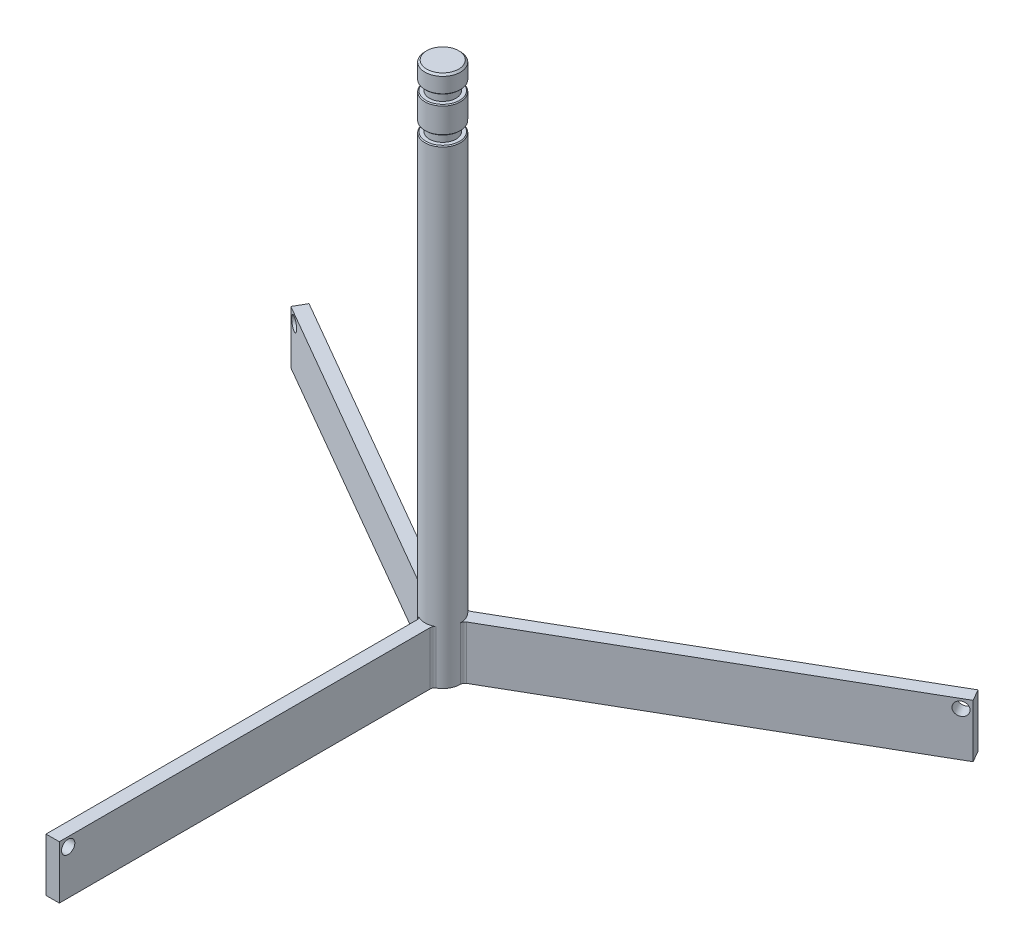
from build123d import *

# Parameters (mm, degrees)
SKETCH1_R                  = 12.7
CENTER_SHAFT_DEPTH         = 381
SKETCH2_W                  = 9.525
SKETCH2_H                  = 38.1
ARM_DEPTH                  = 279.4
SKETCH3_R                  = 4.7625
CUT_EXTRUDE1_DEPTH         = 473.789909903
FILLET1_R                  = 3.175
CIRPATTERN1_COUNT          = 3
FILLET1_OF_CIRPATTERN1_R   = 3.175
SKETCH4_W                  = 5.08
SKETCH4_H                  = 6.35
CHAMFER1_SIZE              = 0.635
LPATTERN1_COUNT            = 2
LPATTERN1_PITCH            = 25.4
CHAMFER1_OF_LPATTERN1_SIZE = 0.635
CHAMFER2_SIZE              = 1.27


with BuildPart() as part:
    # Sketch1 → Center Shaft (new body)
    with BuildSketch(Plane(origin=(0, 0, 0), x_dir=(1, 0, 0), z_dir=(0, 1, 0))):
        with Locations(Location((0, 0, 0), (0, 0, 270))):
            Circle(SKETCH1_R)
    extrude(amount=CENTER_SHAFT_DEPTH)

    # Sketch2 → Arm (add)
    with BuildSketch(Plane.XY):
        with Locations((0, 19.05)):
            Rectangle(SKETCH2_W, SKETCH2_H)
    arm = extrude(amount=ARM_DEPTH)

    # Sketch3 → Cut-Extrude1 (cut, through all)
    with BuildSketch(Plane.ZY.offset(4.7625)):
        with Locations((273.05, 31.75)):
            Circle(SKETCH3_R)
    cut_extrude1 = extrude(amount=-CUT_EXTRUDE1_DEPTH, mode=Mode.SUBTRACT)

    # Fillet1
    fillet1_edges = [part.edges().sort_by_distance(p)[0] for p in [
        (4.7625, 19.05, 11.773215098),
        (-4.7625, 19.05, 11.773215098),
    ]]
    fillet(fillet1_edges, radius=FILLET1_R)

    # CirPattern1: Arm, Cut-Extrude1 ×3 about axis
    cirpattern1_axis = Axis((0, 0, 0), (0, 1, 0))
    add([arm.rotate(cirpattern1_axis, i * 360 / CIRPATTERN1_COUNT) for i in range(1, CIRPATTERN1_COUNT)])
    add([cut_extrude1.rotate(cirpattern1_axis, i * 360 / CIRPATTERN1_COUNT) for i in range(1, CIRPATTERN1_COUNT)], mode=Mode.SUBTRACT)

    # Fillet1 of CirPattern1
    fillet1_of_cirpattern1_edges = [part.edges().sort_by_distance(p)[0] for p in [
        (7.814653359, 19.05, -10.011053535),
        (12.577153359, 19.05, -1.762161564),
        (-12.577153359, 19.05, -1.762161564),
        (-7.814653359, 19.05, -10.011053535),
    ]]
    fillet(fillet1_of_cirpattern1_edges, radius=FILLET1_OF_CIRPATTERN1_R)

    # Sketch4 → Cut-Revolve1 (revolve, cut)
    with BuildSketch(Plane(origin=(0, 0, 0), x_dir=(0, 0, -1), z_dir=(1, 0, 0)), mode=Mode.PRIVATE) as cut_revolve1_sk:
        with Locations((-12.065, 339.725)):
            Rectangle(SKETCH4_W, SKETCH4_H)
    cut_revolve1 = revolve(cut_revolve1_sk.sketch.rotate(Axis((0, 0, 0), (0, 1, 0)), 180), axis=Axis((0, 0, 0), (0, 1, 0)), mode=Mode.SUBTRACT)

    # Chamfer1
    chamfer1_edges = [part.edges().sort_by_distance(p)[0] for p in [
        (0, 336.55, -12.7),
        (0, 342.9, -12.7),
    ]]
    chamfer(chamfer1_edges, length=CHAMFER1_SIZE)

    # LPattern1: Cut-Revolve1 ×2
    with Locations(*[(0, i * LPATTERN1_PITCH, 0) for i in range(1, LPATTERN1_COUNT)]):
        add(cut_revolve1, mode=Mode.SUBTRACT)

    # Chamfer1 of LPattern1
    chamfer1_of_lpattern1_edges = [part.edges().sort_by_distance(p)[0] for p in [
        (0, 361.95, -12.7),
        (0, 368.3, -12.7),
    ]]
    chamfer(chamfer1_of_lpattern1_edges, length=CHAMFER1_OF_LPATTERN1_SIZE)

    # Chamfer2
    chamfer2_edges = [part.edges().sort_by_distance(p)[0] for p in [
        (0, 381, -12.7),
    ]]
    chamfer(chamfer2_edges, length=CHAMFER2_SIZE)


solid = part.part
